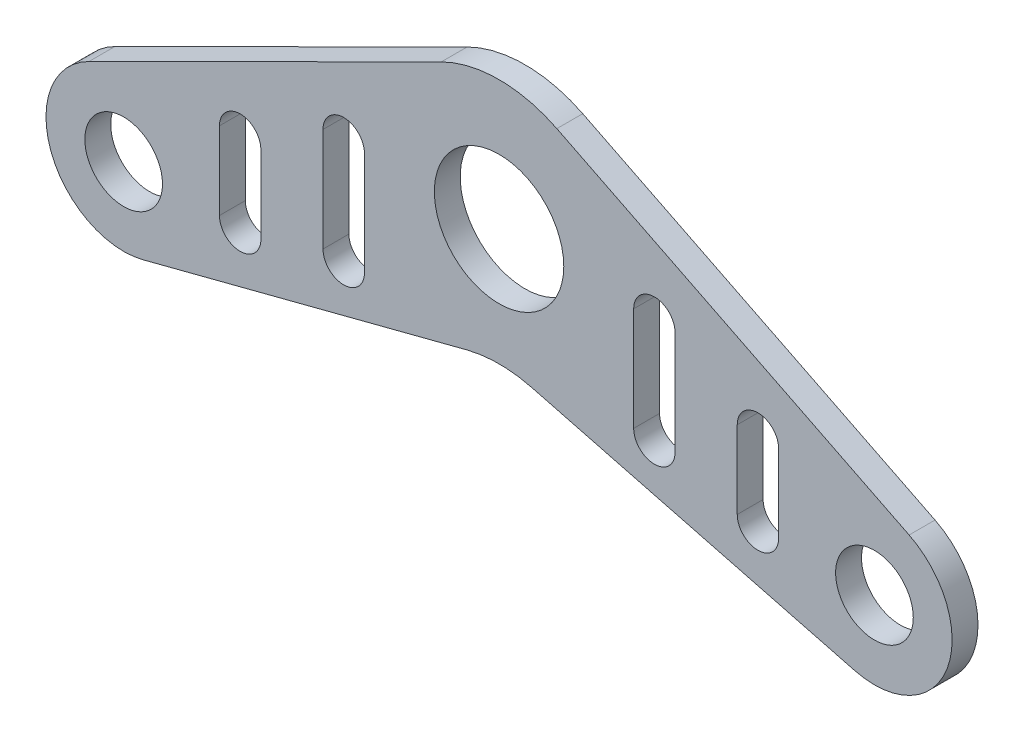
from build123d import *

# Parameters (mm, degrees)
SKETCH1_R           = 25
SKETCH1_R_2         = 15
BOSS_EXTRUDE1_DEPTH = 10
CUT_EXTRUDE1_REACH  = 194.678


with BuildPart() as part:
    # Sketch1 → Boss-Extrude1 (new body)
    with BuildSketch(Plane.XY):
        with BuildLine():
            Line((-158.394414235, -23.156198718), (-22.324023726, 44.739668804))
            ThreePointArc((-22.324023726, 44.739668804), (0, 50), (22.324023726, 44.739668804))
            Line((22.324023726, 44.739668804), (158.394414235, -23.156198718))
            ThreePointArc((158.394414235, -23.156198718), (173.096845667, -60.515096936), (137.479425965, -79.04205513))
            Line((137.479425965, -79.04205513), (12.534290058, -46.686936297))
            ThreePointArc((12.534290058, -46.686936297), (0, -45.090361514), (-12.534290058, -46.686936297))
            Line((-12.534290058, -46.686936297), (-137.479425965, -79.04205513))
            ThreePointArc((-137.479425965, -79.04205513), (-173.096845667, -60.515096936), (-158.394414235, -23.156198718))
        make_face()
        Circle(SKETCH1_R, mode=Mode.SUBTRACT)
        with Locations((-145, -50)):
            Circle(SKETCH1_R_2, mode=Mode.SUBTRACT)
        with Locations((145, -50)):
            Circle(SKETCH1_R_2, mode=Mode.SUBTRACT)
    extrude(amount=BOSS_EXTRUDE1_DEPTH)

    # Sketch2 → Cut-Extrude1 (cut, up to next)
    with BuildSketch(Plane.XY.offset(10), mode=Mode.PRIVATE) as cut_extrude1_sk1:
        with BuildLine():
            Line((-52, -0.689655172), (-52, -40.689655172))
            ThreePointArc((-52, -40.689655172), (-60, -48.689655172), (-68, -40.689655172))
            Line((-68, -40.689655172), (-68, -0.689655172))
            ThreePointArc((-68, -0.689655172), (-60, 7.310344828), (-52, -0.689655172))
        make_face()
    cut_extrude1_tool1 = extrude(cut_extrude1_sk1.sketch, amount=-CUT_EXTRUDE1_REACH, mode=Mode.PRIVATE) & part.part
    # Sketch2 → Cut-Extrude1 (cut, up to next)
    with BuildSketch(Plane.XY.offset(10), mode=Mode.PRIVATE) as cut_extrude1_sk2:
        with BuildLine():
            Line((-92, -19.482758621), (-92, -49.482758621))
            ThreePointArc((-92, -49.482758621), (-100, -57.482758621), (-108, -49.482758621))
            Line((-108, -49.482758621), (-108, -19.482758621))
            ThreePointArc((-108, -19.482758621), (-100, -11.482758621), (-92, -19.482758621))
        make_face()
    cut_extrude1_tool2 = extrude(cut_extrude1_sk2.sketch, amount=-CUT_EXTRUDE1_REACH, mode=Mode.PRIVATE) & part.part
    cut_extrude1_1 = cut_extrude1_tool1.solids().sort_by_distance((-60, -20.689655, 10))[0]
    add(cut_extrude1_1, mode=Mode.SUBTRACT)
    cut_extrude1_2 = cut_extrude1_tool2.solids().sort_by_distance((-100, -34.482759, 10))[0]
    add(cut_extrude1_2, mode=Mode.SUBTRACT)
    cut_extrude1 = cut_extrude1_1 + cut_extrude1_2  # Cut-Extrude1 as one shape, for the pattern or mirror that repeats it

    # Mirror1: Cut-Extrude1 across plane
    add(cut_extrude1.mirror(Plane(origin=(0, 0, 0), x_dir=(0, 0, 1), z_dir=(1, 0, 0))), mode=Mode.SUBTRACT)


solid = part.part
